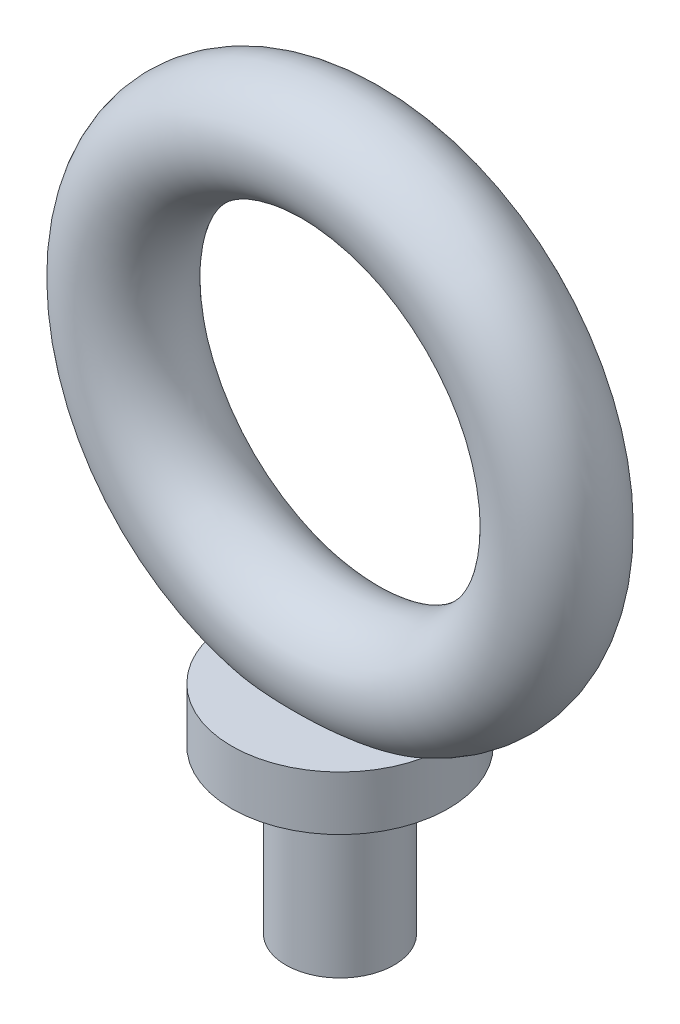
from build123d import *
from build123d.topology import SkipClean

# Parameters (mm, degrees)
SKETCH1_R      = 6.35
EXTRUDE1_DEPTH = 25.4
SKETCH2_R      = 12.7
EXTRUDE2_DEPTH = 6.35
SKETCH3_R      = 6.35


with BuildPart() as part:
    # Sketch1 → Extrude1 (new body)
    with BuildSketch(Plane(origin=(0, 0, 0), x_dir=(1, 0, 0), z_dir=(0, 1, 0))):
        with Locations(Location((0, 0, 0), (0, 0, 270))):
            Circle(SKETCH1_R)
    extrude(amount=EXTRUDE1_DEPTH)

    # Sketch2 → Extrude2 (add)
    with BuildSketch(Plane(origin=(0, 25.4, 0), x_dir=(-1, 0, 0), z_dir=(0, 1, 0))):
        with Locations(Location((0, 0, 0), (0, 0, 90))):
            Circle(SKETCH2_R)
    extrude(amount=-EXTRUDE2_DEPTH)

    # Sweep2: sweep along a path in Sketch7
    with SkipClean():  # the faces are left unmerged after this step: merging them gives an invalid solid
        with BuildLine(Plane.XY) as sweep2_path:
            CenterArc((0, 53.975), 25.4, 0, 360)
        # Sketch3 → Sweep2 (sweep)
        with BuildSketch(Plane(origin=(0, 0, 0), x_dir=(0, 0, -1), z_dir=(1, 0, 0))):
            with Locations((0, 28.575)):
                Circle(SKETCH3_R)
        sweep(path=sweep2_path.line)


solid = part.part
